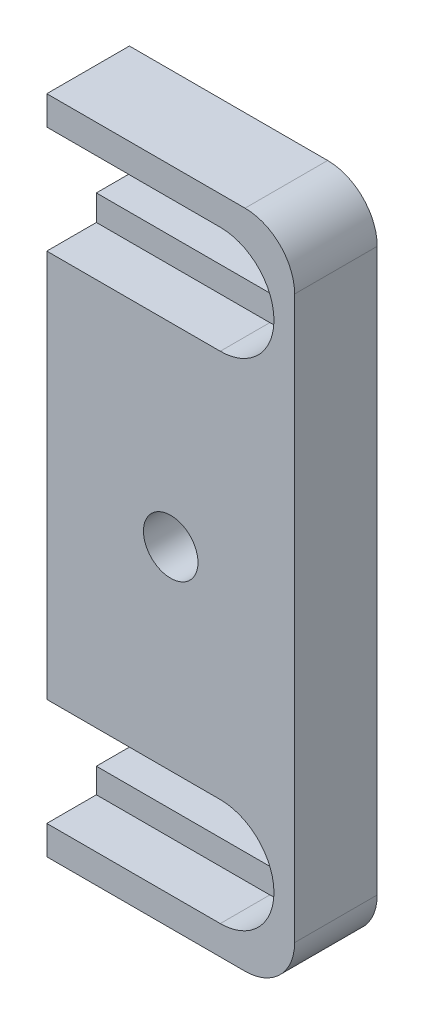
from build123d import *

# Parameters (mm, degrees)
SKETCH1_W             = 15
SKETCH1_H             = 40
BOSS_EXTRUDE1_DEPTH   = 5
CUT_EXTRUDE1_DEPTH    = 3
CUT_EXTRUDE2_DEPTH    = 43.825226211
CUT_EXTRUDE3_DEPTH    = 3
CUT_EXTRUDE4_DEPTH    = 44.011626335
F_4_CLEARANCE_HOLE1_D = 3.3
FILLET1_R             = 3


with BuildPart() as part:
    # Sketch1 → Boss-Extrude1 (new body)
    with BuildSketch(Plane.XY.offset(5)):
        with Locations((7.5, -20)):
            Rectangle(SKETCH1_W, SKETCH1_H)
    extrude(amount=-BOSS_EXTRUDE1_DEPTH)

    # Sketch2 → Cut-Extrude1 (cut)
    with BuildSketch(Plane.XY.offset(5)):
        with BuildLine():
            Line((0, -8.25), (10.5, -8.25))
            ThreePointArc((10.5, -8.25), (13.75, -5), (10.5, -1.75))
            Line((10.5, -1.75), (0, -1.75))
            Line((0, -1.75), (0, -8.25))
        make_face()
    extrude(amount=-CUT_EXTRUDE1_DEPTH, mode=Mode.SUBTRACT)

    # Sketch3 → Cut-Extrude2 (cut, through all)
    with BuildSketch(Plane.XY.offset(2)):
        with BuildLine():
            Line((0, -3.3), (0, -6.7))
            Line((0, -6.7), (10.5, -6.7))
            ThreePointArc((10.5, -6.7), (12.2, -5), (10.5, -3.3))
            Line((10.5, -3.3), (0, -3.3))
        make_face()
    extrude(amount=-CUT_EXTRUDE2_DEPTH, mode=Mode.SUBTRACT)

    # Sketch4 → Cut-Extrude3 (cut)
    with BuildSketch(Plane.XY.offset(5)):
        with BuildLine():
            Line((0, -38.25), (10.5, -38.25))
            ThreePointArc((10.5, -38.25), (13.75, -35), (10.5, -31.75))
            Line((10.5, -31.75), (0, -31.75))
            Line((0, -31.75), (0, -38.25))
        make_face()
    extrude(amount=-CUT_EXTRUDE3_DEPTH, mode=Mode.SUBTRACT)

    # Sketch5 → Cut-Extrude4 (cut, through all)
    with BuildSketch(Plane(origin=(0, 0, 0), x_dir=(-1, 0, 0), z_dir=(0, 0, -1))):
        with BuildLine():
            Line((0, -36.75), (0, -33.25))
            Line((0, -33.25), (-10.5, -33.25))
            ThreePointArc((-10.5, -33.25), (-12.25, -35), (-10.5, -36.75))
            Line((-10.5, -36.75), (0, -36.75))
        make_face()
    extrude(amount=-CUT_EXTRUDE4_DEPTH, mode=Mode.SUBTRACT)

    # 4 Clearance Hole1 (through all)
    with Locations(Plane.XY.offset(5)):
        with Locations((7.5, -20)):
            Hole(F_4_CLEARANCE_HOLE1_D / 2)

    # Fillet1
    fillet1_edges = [part.edges().sort_by_distance(p)[0] for p in [
        (15, -40, 2.5),
        (15, 0, 2.5),
    ]]
    fillet(fillet1_edges, radius=FILLET1_R)


solid = part.part
